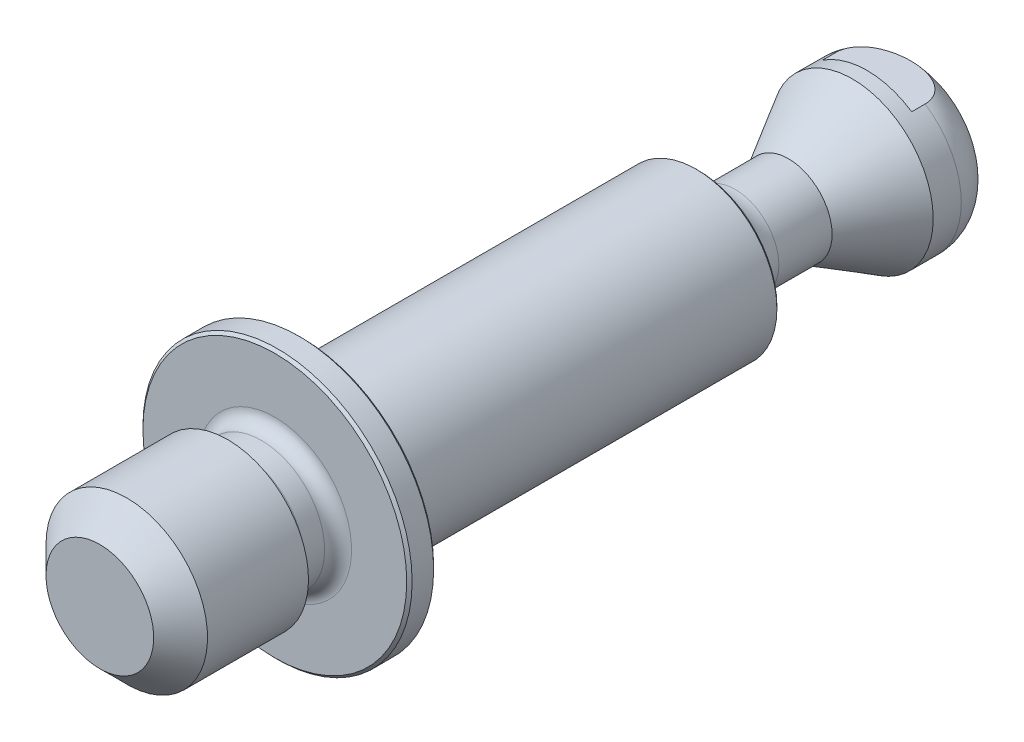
ISO-10303-21;
HEADER;
FILE_DESCRIPTION(('STEP AP214'),'2;1');
FILE_NAME('part.step','',(''),(''),'','','');
FILE_SCHEMA(('AUTOMOTIVE_DESIGN { 1 0 10303 214 1 1 1 1 }'));
ENDSEC;
DATA;
#1=APPLICATION_CONTEXT('core data for automotive mechanical design processes');
#2=APPLICATION_PROTOCOL_DEFINITION('international standard','automotive_design',2000,#1);
#3=PRODUCT_CONTEXT('',#1,'mechanical');
#4=PRODUCT('Part','Part','',(#3));
#5=PRODUCT_RELATED_PRODUCT_CATEGORY('part','',(#4));
#6=PRODUCT_DEFINITION_FORMATION('','',#4);
#7=PRODUCT_DEFINITION_CONTEXT('part definition',#1,'design');
#8=PRODUCT_DEFINITION('design','',#6,#7);
#9=PRODUCT_DEFINITION_SHAPE('','',#8);
#10=(LENGTH_UNIT() NAMED_UNIT(*) SI_UNIT(.MILLI.,.METRE.));
#11=(NAMED_UNIT(*) PLANE_ANGLE_UNIT() SI_UNIT($,.RADIAN.));
#12=(NAMED_UNIT(*) SI_UNIT($,.STERADIAN.) SOLID_ANGLE_UNIT());
#13=UNCERTAINTY_MEASURE_WITH_UNIT(LENGTH_MEASURE(1.E-05),#10,'distance_accuracy_value','');
#14=(GEOMETRIC_REPRESENTATION_CONTEXT(3) GLOBAL_UNCERTAINTY_ASSIGNED_CONTEXT((#13)) GLOBAL_UNIT_ASSIGNED_CONTEXT((#10,
#11,#12)) REPRESENTATION_CONTEXT('',''));
#15=CARTESIAN_POINT('',(0.,0.,0.));
#16=DIRECTION('',(0.,0.,1.));
#17=DIRECTION('',(1.,0.,0.));
#18=AXIS2_PLACEMENT_3D('',#15,#16,#17);
#19=CARTESIAN_POINT('',(0.,0.,0.));
#20=DIRECTION('',(0.,0.,1.));
#21=DIRECTION('',(-1.,0.,0.));
#22=AXIS2_PLACEMENT_3D('',#19,#20,#21);
#23=PLANE('',#22);
#24=CARTESIAN_POINT('',(0.,0.,0.));
#25=DIRECTION('',(0.,0.,1.));
#26=DIRECTION('',(-1.,0.,0.));
#27=AXIS2_PLACEMENT_3D('',#24,#25,#26);
#28=CIRCLE('',#27,9.8);
#29=CARTESIAN_POINT('',(-9.8,0.,0.));
#30=VERTEX_POINT('',#29);
#31=EDGE_CURVE('E154',#30,#30,#28,.T.);
#32=ORIENTED_EDGE('',*,*,#31,.T.);
#33=EDGE_LOOP('',(#32));
#34=FACE_BOUND('',#33,.T.);
#35=CARTESIAN_POINT('',(0.,0.,0.));
#36=DIRECTION('',(0.,0.,1.));
#37=DIRECTION('',(-1.,0.,0.));
#38=AXIS2_PLACEMENT_3D('',#35,#36,#37);
#39=CIRCLE('',#38,5.7);
#40=CARTESIAN_POINT('',(-5.7,0.,0.));
#41=VERTEX_POINT('',#40);
#42=EDGE_CURVE('E142',#41,#41,#39,.F.);
#43=ORIENTED_EDGE('',*,*,#42,.T.);
#44=EDGE_LOOP('',(#43));
#45=FACE_BOUND('',#44,.T.);
#46=ADVANCED_FACE('F15',(#34,#45),#23,.T.);
#47=CARTESIAN_POINT('',(0.,0.,0.));
#48=DIRECTION('',(0.,0.,-1.));
#49=DIRECTION('',(1.,0.,0.));
#50=AXIS2_PLACEMENT_3D('',#47,#48,#49);
#51=CYLINDRICAL_SURFACE('',#50,10.);
#52=CARTESIAN_POINT('',(0.,0.,-0.199999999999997));
#53=DIRECTION('',(0.,0.,1.));
#54=DIRECTION('',(-1.,0.,0.));
#55=AXIS2_PLACEMENT_3D('',#52,#53,#54);
#56=CIRCLE('',#55,10.);
#57=CARTESIAN_POINT('',(-10.,0.,-0.199999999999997));
#58=VERTEX_POINT('',#57);
#59=EDGE_CURVE('E150',#58,#58,#56,.F.);
#60=ORIENTED_EDGE('',*,*,#59,.T.);
#61=EDGE_LOOP('',(#60));
#62=FACE_BOUND('',#61,.T.);
#63=CARTESIAN_POINT('',(0.,0.,-1.8));
#64=DIRECTION('',(0.,0.,-1.));
#65=DIRECTION('',(1.,0.,0.));
#66=AXIS2_PLACEMENT_3D('',#63,#64,#65);
#67=CIRCLE('',#66,10.);
#68=CARTESIAN_POINT('',(10.,0.,-1.8));
#69=VERTEX_POINT('',#68);
#70=EDGE_CURVE('E146',#69,#69,#67,.F.);
#71=ORIENTED_EDGE('',*,*,#70,.T.);
#72=EDGE_LOOP('',(#71));
#73=FACE_BOUND('',#72,.T.);
#74=ADVANCED_FACE('F224',(#62,#73),#51,.T.);
#75=CARTESIAN_POINT('',(10.,0.,-2.));
#76=DIRECTION('',(0.,0.,-1.));
#77=DIRECTION('',(1.,0.,0.));
#78=AXIS2_PLACEMENT_3D('',#75,#76,#77);
#79=PLANE('',#78);
#80=CARTESIAN_POINT('',(0.,0.,-2.));
#81=DIRECTION('',(0.,0.,-1.));
#82=DIRECTION('',(1.,0.,0.));
#83=AXIS2_PLACEMENT_3D('',#80,#81,#82);
#84=CIRCLE('',#83,6.4);
#85=CARTESIAN_POINT('',(6.4,0.,-2.));
#86=VERTEX_POINT('',#85);
#87=EDGE_CURVE('E9',#86,#86,#84,.F.);
#88=ORIENTED_EDGE('',*,*,#87,.T.);
#89=EDGE_LOOP('',(#88));
#90=FACE_BOUND('',#89,.T.);
#91=CARTESIAN_POINT('',(0.,0.,-2.));
#92=DIRECTION('',(0.,0.,-1.));
#93=DIRECTION('',(1.,0.,0.));
#94=AXIS2_PLACEMENT_3D('',#91,#92,#93);
#95=CIRCLE('',#94,9.8);
#96=CARTESIAN_POINT('',(9.8,0.,-2.));
#97=VERTEX_POINT('',#96);
#98=EDGE_CURVE('E158',#97,#97,#95,.T.);
#99=ORIENTED_EDGE('',*,*,#98,.T.);
#100=EDGE_LOOP('',(#99));
#101=FACE_BOUND('',#100,.T.);
#102=ADVANCED_FACE('F220',(#90,#101),#79,.T.);
#103=CARTESIAN_POINT('',(0.,0.,0.));
#104=DIRECTION('',(0.,0.,-1.));
#105=DIRECTION('',(1.,0.,0.));
#106=AXIS2_PLACEMENT_3D('',#103,#104,#105);
#107=CYLINDRICAL_SURFACE('',#106,6.);
#108=CARTESIAN_POINT('',(0.,0.,-2.4));
#109=DIRECTION('',(0.,0.,-1.));
#110=DIRECTION('',(1.,0.,0.));
#111=AXIS2_PLACEMENT_3D('',#108,#109,#110);
#112=CIRCLE('',#111,6.);
#113=CARTESIAN_POINT('',(6.,0.,-2.4));
#114=VERTEX_POINT('',#113);
#115=EDGE_CURVE('E24',#114,#114,#112,.T.);
#116=ORIENTED_EDGE('',*,*,#115,.T.);
#117=EDGE_LOOP('',(#116));
#118=FACE_BOUND('',#117,.T.);
#119=CARTESIAN_POINT('',(0.,0.,-31.3));
#120=DIRECTION('',(0.,0.,-1.));
#121=DIRECTION('',(1.,0.,0.));
#122=AXIS2_PLACEMENT_3D('',#119,#120,#121);
#123=CIRCLE('',#122,6.);
#124=CARTESIAN_POINT('',(6.,0.,-31.3));
#125=VERTEX_POINT('',#124);
#126=EDGE_CURVE('E111',#125,#125,#123,.F.);
#127=ORIENTED_EDGE('',*,*,#126,.T.);
#128=EDGE_LOOP('',(#127));
#129=FACE_BOUND('',#128,.T.);
#130=ADVANCED_FACE('F216',(#118,#129),#107,.T.);
#131=CARTESIAN_POINT('',(0.,0.,0.));
#132=DIRECTION('',(0.,0.,-1.));
#133=DIRECTION('',(1.,0.,0.));
#134=AXIS2_PLACEMENT_3D('',#131,#132,#133);
#135=CYLINDRICAL_SURFACE('',#134,3.25);
#136=CARTESIAN_POINT('',(0.,0.,-34.1958301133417));
#137=DIRECTION('',(0.,0.,1.));
#138=DIRECTION('',(-1.,0.,0.));
#139=AXIS2_PLACEMENT_3D('',#136,#137,#138);
#140=CIRCLE('',#139,3.25);
#141=CARTESIAN_POINT('',(-3.25,0.,-34.1958301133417));
#142=VERTEX_POINT('',#141);
#143=EDGE_CURVE('E115',#142,#142,#140,.F.);
#144=ORIENTED_EDGE('',*,*,#143,.T.);
#145=EDGE_LOOP('',(#144));
#146=FACE_BOUND('',#145,.T.);
#147=CARTESIAN_POINT('',(0.,0.,-38.15));
#148=DIRECTION('',(0.,0.,-1.));
#149=DIRECTION('',(1.,0.,0.));
#150=AXIS2_PLACEMENT_3D('',#147,#148,#149);
#151=CIRCLE('',#150,3.25);
#152=CARTESIAN_POINT('',(3.25,0.,-38.15));
#153=VERTEX_POINT('',#152);
#154=EDGE_CURVE('E97',#153,#153,#151,.T.);
#155=ORIENTED_EDGE('',*,*,#154,.F.);
#156=EDGE_LOOP('',(#155));
#157=FACE_BOUND('',#156,.T.);
#158=ADVANCED_FACE('F212',(#146,#157),#135,.T.);
#159=CARTESIAN_POINT('',(0.,0.,-42.9131397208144));
#160=DIRECTION('',(0.,0.,-1.));
#161=DIRECTION('',(1.,0.,0.));
#162=AXIS2_PLACEMENT_3D('',#159,#160,#161);
#163=CONICAL_SURFACE('',#162,6.,0.523598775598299);
#164=ORIENTED_EDGE('',*,*,#154,.T.);
#165=EDGE_LOOP('',(#164));
#166=FACE_BOUND('',#165,.T.);
#167=CARTESIAN_POINT('',(0.,0.,-42.9131397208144));
#168=DIRECTION('',(0.,0.,-1.));
#169=DIRECTION('',(1.,0.,0.));
#170=AXIS2_PLACEMENT_3D('',#167,#168,#169);
#171=CIRCLE('',#170,6.);
#172=CARTESIAN_POINT('',(6.,0.,-42.9131397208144));
#173=VERTEX_POINT('',#172);
#174=EDGE_CURVE('E93',#173,#173,#171,.T.);
#175=ORIENTED_EDGE('',*,*,#174,.F.);
#176=EDGE_LOOP('',(#175));
#177=FACE_BOUND('',#176,.T.);
#178=ADVANCED_FACE('F209',(#166,#177),#163,.T.);
#179=CARTESIAN_POINT('',(0.,0.,0.));
#180=DIRECTION('',(0.,0.,-1.));
#181=DIRECTION('',(1.,0.,0.));
#182=AXIS2_PLACEMENT_3D('',#179,#180,#181);
#183=CYLINDRICAL_SURFACE('',#182,6.);
#184=DIRECTION('',(0.,0.,-1.));
#185=VECTOR('',#184,1.);
#186=CARTESIAN_POINT('',(3.31662479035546,-5.,0.));
#187=LINE('',#186,#185);
#188=CARTESIAN_POINT('',(3.31662479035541,-5.,-45.));
#189=VERTEX_POINT('',#188);
#190=CARTESIAN_POINT('',(3.31662479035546,-5.,-44.));
#191=VERTEX_POINT('',#190);
#192=EDGE_CURVE('E67',#189,#191,#187,.F.);
#193=ORIENTED_EDGE('',*,*,#192,.F.);
#194=CARTESIAN_POINT('',(0.,0.,-45.));
#195=DIRECTION('',(0.,0.,-1.));
#196=DIRECTION('',(1.,0.,0.));
#197=AXIS2_PLACEMENT_3D('',#194,#195,#196);
#198=CIRCLE('',#197,6.);
#199=CARTESIAN_POINT('',(3.31662479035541,5.,-45.));
#200=VERTEX_POINT('',#199);
#201=EDGE_CURVE('E39',#189,#200,#198,.F.);
#202=ORIENTED_EDGE('',*,*,#201,.T.);
#203=DIRECTION('',(0.,0.,-1.));
#204=VECTOR('',#203,1.);
#205=CARTESIAN_POINT('',(3.31662479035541,5.,0.));
#206=LINE('',#205,#204);
#207=CARTESIAN_POINT('',(3.31662479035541,5.,-44.));
#208=VERTEX_POINT('',#207);
#209=EDGE_CURVE('E86',#208,#200,#206,.T.);
#210=ORIENTED_EDGE('',*,*,#209,.F.);
#211=CARTESIAN_POINT('',(0.,0.,-44.));
#212=DIRECTION('',(0.,0.,1.));
#213=DIRECTION('',(0.,-1.,0.));
#214=AXIS2_PLACEMENT_3D('',#211,#212,#213);
#215=CIRCLE('',#214,6.);
#216=CARTESIAN_POINT('',(-3.31662479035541,5.,-44.));
#217=VERTEX_POINT('',#216);
#218=EDGE_CURVE('E170',#217,#208,#215,.F.);
#219=ORIENTED_EDGE('',*,*,#218,.F.);
#220=DIRECTION('',(0.,0.,-1.));
#221=VECTOR('',#220,1.);
#222=CARTESIAN_POINT('',(-3.31662479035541,5.,0.));
#223=LINE('',#222,#221);
#224=CARTESIAN_POINT('',(-3.31662479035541,5.,-45.));
#225=VERTEX_POINT('',#224);
#226=EDGE_CURVE('E89',#225,#217,#223,.F.);
#227=ORIENTED_EDGE('',*,*,#226,.F.);
#228=CARTESIAN_POINT('',(-3.31662479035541,-5.,-45.));
#229=VERTEX_POINT('',#228);
#230=EDGE_CURVE('E75',#225,#229,#198,.F.);
#231=ORIENTED_EDGE('',*,*,#230,.T.);
#232=DIRECTION('',(0.,0.,-1.));
#233=VECTOR('',#232,1.);
#234=CARTESIAN_POINT('',(-3.31662479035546,-5.,0.));
#235=LINE('',#234,#233);
#236=CARTESIAN_POINT('',(-3.31662479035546,-5.,-44.));
#237=VERTEX_POINT('',#236);
#238=EDGE_CURVE('E31',#237,#229,#235,.T.);
#239=ORIENTED_EDGE('',*,*,#238,.F.);
#240=CARTESIAN_POINT('',(0.,0.,-44.));
#241=DIRECTION('',(0.,0.,1.));
#242=DIRECTION('',(0.,-1.,0.));
#243=AXIS2_PLACEMENT_3D('',#240,#241,#242);
#244=CIRCLE('',#243,6.);
#245=EDGE_CURVE('E60',#191,#237,#244,.F.);
#246=ORIENTED_EDGE('',*,*,#245,.F.);
#247=EDGE_LOOP('',(#193,#202,#210,#219,#227,#231,#239,#246));
#248=FACE_BOUND('',#247,.T.);
#249=ORIENTED_EDGE('',*,*,#174,.T.);
#250=EDGE_LOOP('',(#249));
#251=FACE_BOUND('',#250,.T.);
#252=ADVANCED_FACE('F71',(#248,#251),#183,.T.);
#253=CARTESIAN_POINT('',(0.,0.,-48.));
#254=DIRECTION('',(0.,0.,-1.));
#255=DIRECTION('',(1.,0.,0.));
#256=AXIS2_PLACEMENT_3D('',#253,#254,#255);
#257=PLANE('',#256);
#258=CARTESIAN_POINT('',(0.,0.,-48.));
#259=DIRECTION('',(0.,0.,-1.));
#260=DIRECTION('',(1.,0.,0.));
#261=AXIS2_PLACEMENT_3D('',#258,#259,#260);
#262=CIRCLE('',#261,3.);
#263=CARTESIAN_POINT('',(3.,0.,-48.));
#264=VERTEX_POINT('',#263);
#265=EDGE_CURVE('E101',#264,#264,#262,.T.);
#266=ORIENTED_EDGE('',*,*,#265,.T.);
#267=EDGE_LOOP('',(#266));
#268=FACE_BOUND('',#267,.T.);
#269=ADVANCED_FACE('F203',(#268),#257,.T.);
#270=CARTESIAN_POINT('',(0.,0.,-45.));
#271=DIRECTION('',(0.,0.,-1.));
#272=DIRECTION('',(1.,0.,0.));
#273=AXIS2_PLACEMENT_3D('',#270,#271,#272);
#274=DEGENERATE_TOROIDAL_SURFACE('',#273,3.,3.,.T.);
#275=CARTESIAN_POINT('',(0.,-5.,-47.2360679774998));
#276=CARTESIAN_POINT('',(0.120918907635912,-5.,-47.2360654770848));
#277=CARTESIAN_POINT('',(0.241827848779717,-5.,-47.2321569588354));
#278=CARTESIAN_POINT('',(0.483117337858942,-5.,-47.2163673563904));
#279=CARTESIAN_POINT('',(0.603497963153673,-5.,-47.204487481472));
#280=CARTESIAN_POINT('',(0.843175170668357,-5.,-47.172309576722));
#281=CARTESIAN_POINT('',(0.962471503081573,-5.,-47.1520096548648));
#282=CARTESIAN_POINT('',(1.19911813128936,-5.,-47.1022831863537));
#283=CARTESIAN_POINT('',(1.31646901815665,-5.,-47.0728594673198));
#284=CARTESIAN_POINT('',(1.59010251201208,-5.,-46.9914925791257));
#285=CARTESIAN_POINT('',(1.74515200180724,-5.,-46.9352545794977));
#286=CARTESIAN_POINT('',(2.0457254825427,-5.,-46.8013699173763));
#287=CARTESIAN_POINT('',(2.19126336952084,-5.,-46.7237553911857));
#288=CARTESIAN_POINT('',(2.43890308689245,-5.,-46.5627711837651));
#289=CARTESIAN_POINT('',(2.54382254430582,-5.,-46.4837739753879));
#290=CARTESIAN_POINT('',(2.7396282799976,-5.,-46.3098769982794));
#291=CARTESIAN_POINT('',(2.83053188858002,-5.,-46.214997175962));
#292=CARTESIAN_POINT('',(2.97723052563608,-5.,-46.0301159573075));
#293=CARTESIAN_POINT('',(3.0364145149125,-5.,-45.942813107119));
#294=CARTESIAN_POINT('',(3.13957828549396,-5.,-45.7595839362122));
#295=CARTESIAN_POINT('',(3.18356514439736,-5.,-45.663661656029));
#296=CARTESIAN_POINT('',(3.25393965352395,-5.,-45.4648474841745));
#297=CARTESIAN_POINT('',(3.28022077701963,-5.,-45.3619174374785));
#298=CARTESIAN_POINT('',(3.31290834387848,-5.,-45.1529411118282));
#299=CARTESIAN_POINT('',(3.31932342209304,-5.,-45.0468962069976));
#300=CARTESIAN_POINT('',(3.31222176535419,-5.,-44.8462659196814));
#301=CARTESIAN_POINT('',(3.30065386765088,-5.,-44.7516055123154));
#302=CARTESIAN_POINT('',(3.26181910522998,-5.,-44.5655953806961));
#303=CARTESIAN_POINT('',(3.23455371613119,-5.,-44.4742453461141));
#304=CARTESIAN_POINT('',(3.16568011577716,-5.,-44.2967666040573));
#305=CARTESIAN_POINT('',(3.12401645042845,-5.,-44.2106596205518));
#306=CARTESIAN_POINT('',(3.02836892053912,-5.,-44.0456244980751));
#307=CARTESIAN_POINT('',(2.97437928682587,-5.,-43.9666997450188));
#308=CARTESIAN_POINT('',(2.83319578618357,-5.,-43.7878200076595));
#309=CARTESIAN_POINT('',(2.74125094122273,-5.,-43.6916074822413));
#310=CARTESIAN_POINT('',(2.54296994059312,-5.,-43.5154254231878));
#311=CARTESIAN_POINT('',(2.43660860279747,-5.,-43.4354849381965));
#312=CARTESIAN_POINT('',(2.16830650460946,-5.,-43.2616870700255));
#313=CARTESIAN_POINT('',(2.0014223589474,-5.,-43.1755042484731));
#314=CARTESIAN_POINT('',(1.65626349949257,-5.,-43.0302057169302));
#315=CARTESIAN_POINT('',(1.47796334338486,-5.,-42.9711530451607));
#316=CARTESIAN_POINT('',(1.15914275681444,-5.,-42.8876929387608));
#317=CARTESIAN_POINT('',(1.01985771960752,-5.,-42.8583678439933));
#318=CARTESIAN_POINT('',(0.739223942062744,-5.,-42.8117236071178));
#319=CARTESIAN_POINT('',(0.597874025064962,-5.,-42.7944116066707));
#320=CARTESIAN_POINT('',(0.314037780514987,-5.,-42.7709143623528));
#321=CARTESIAN_POINT('',(0.171549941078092,-5.,-42.7647478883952));
#322=CARTESIAN_POINT('',(-0.113440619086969,-5.,-42.7632671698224));
#323=CARTESIAN_POINT('',(-0.25594331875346,-5.,-42.7679492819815));
#324=CARTESIAN_POINT('',(-0.518018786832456,-5.,-42.7868218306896));
#325=CARTESIAN_POINT('',(-0.637707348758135,-5.,-42.7994184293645));
#326=CARTESIAN_POINT('',(-0.875936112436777,-5.,-42.8330000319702));
#327=CARTESIAN_POINT('',(-0.99447616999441,-5.,-42.8539860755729));
#328=CARTESIAN_POINT('',(-1.22924960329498,-5.,-42.9049977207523));
#329=CARTESIAN_POINT('',(-1.34548886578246,-5.,-42.9349958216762));
#330=CARTESIAN_POINT('',(-1.57487815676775,-5.,-43.0049676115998));
#331=CARTESIAN_POINT('',(-1.68802992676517,-5.,-43.0449355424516));
#332=CARTESIAN_POINT('',(-1.93726711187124,-5.,-43.1471729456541));
#333=CARTESIAN_POINT('',(-2.07212579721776,-5.,-43.2125115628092));
#334=CARTESIAN_POINT('',(-2.33077391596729,-5.,-43.3624490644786));
#335=CARTESIAN_POINT('',(-2.45457463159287,-5.,-43.4470279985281));
#336=CARTESIAN_POINT('',(-2.66253632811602,-5.,-43.6179675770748));
#337=CARTESIAN_POINT('',(-2.7496924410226,-5.,-43.7006594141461));
#338=CARTESIAN_POINT('',(-2.909419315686,-5.,-43.8791550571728));
#339=CARTESIAN_POINT('',(-2.98200679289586,-5.,-43.9749436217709));
#340=CARTESIAN_POINT('',(-3.0982354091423,-5.,-44.1618145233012));
#341=CARTESIAN_POINT('',(-3.14465751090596,-5.,-44.2511615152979));
#342=CARTESIAN_POINT('',(-3.22195881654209,-5.,-44.4363821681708));
#343=CARTESIAN_POINT('',(-3.25284467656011,-5.,-44.5322530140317));
#344=CARTESIAN_POINT('',(-3.29731276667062,-5.,-44.7283734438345));
#345=CARTESIAN_POINT('',(-3.31082509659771,-5.,-44.8286390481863));
#346=CARTESIAN_POINT('',(-3.31940920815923,-5.,-45.0299567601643));
#347=CARTESIAN_POINT('',(-3.31448404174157,-5.,-45.1310087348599));
#348=CARTESIAN_POINT('',(-3.28751634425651,-5.,-45.3236265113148));
#349=CARTESIAN_POINT('',(-3.26668052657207,-5.,-45.4153652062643));
#350=CARTESIAN_POINT('',(-3.21051142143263,-5.,-45.5942547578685));
#351=CARTESIAN_POINT('',(-3.17517729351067,-5.,-45.6814053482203));
#352=CARTESIAN_POINT('',(-3.08996682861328,-5.,-45.8529027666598));
#353=CARTESIAN_POINT('',(-3.03953428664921,-5.,-45.9369712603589));
#354=CARTESIAN_POINT('',(-2.92708168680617,-5.,-46.0969044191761));
#355=CARTESIAN_POINT('',(-2.86505640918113,-5.,-46.1727653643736));
#356=CARTESIAN_POINT('',(-2.70091379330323,-5.,-46.3486262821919));
#357=CARTESIAN_POINT('',(-2.59347912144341,-5.,-46.4436767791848));
#358=CARTESIAN_POINT('',(-2.3646875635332,-5.,-46.6152304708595));
#359=CARTESIAN_POINT('',(-2.24329783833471,-5.,-46.6916885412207));
#360=CARTESIAN_POINT('',(-1.93419060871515,-5.,-46.8581380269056));
#361=CARTESIAN_POINT('',(-1.74132926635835,-5.,-46.9385798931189));
#362=CARTESIAN_POINT('',(-1.44490972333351,-5.,-47.0360436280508));
#363=CARTESIAN_POINT('',(-1.34482286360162,-5.,-47.0646801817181));
#364=CARTESIAN_POINT('',(-1.14288449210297,-5.,-47.1148876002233));
#365=CARTESIAN_POINT('',(-1.04103334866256,-5.,-47.1364599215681));
#366=CARTESIAN_POINT('',(-0.783859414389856,-5.,-47.1824311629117));
#367=CARTESIAN_POINT('',(-0.627789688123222,-5.,-47.2026484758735));
#368=CARTESIAN_POINT('',(-0.314474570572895,-5.,-47.2294704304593));
#369=CARTESIAN_POINT('',(-0.157228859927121,-5.,-47.2360712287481));
#370=CARTESIAN_POINT('',(0.,-5.,-47.2360679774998));
#371=B_SPLINE_CURVE_WITH_KNOTS('',3,(#275,#276,#277,#278,#279,#280,#281,#282,#283,#284,#285,
#286,#287,#288,#289,#290,#291,#292,#293,#294,#295,#296,#297,#298,#299,#300,#301,#302,#303,#304,
#305,#306,#307,#308,#309,#310,#311,#312,#313,#314,#315,#316,#317,#318,#319,#320,#321,#322,#323,
#324,#325,#326,#327,#328,#329,#330,#331,#332,#333,#334,#335,#336,#337,#338,#339,#340,#341,#342,
#343,#344,#345,#346,#347,#348,#349,#350,#351,#352,#353,#354,#355,#356,#357,#358,#359,#360,#361,
#362,#363,#364,#365,#366,#367,#368,#369,#370),.UNSPECIFIED.,.T.,.F.,(4,2,2,2,2,2,2,2,2,2,2,2,2,
2,2,2,2,2,2,2,2,2,2,2,2,2,2,2,2,2,2,2,2,2,2,2,2,2,2,2,2,2,2,2,2,2,2,4),(0.,0.362673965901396,
0.725292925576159,1.08799341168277,1.45058160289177,1.94401806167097,2.43671672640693,
2.8293214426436,3.22143674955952,3.53657847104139,3.85157322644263,4.16844661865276,
4.48518226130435,4.76990781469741,5.05460660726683,5.34041435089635,5.6263561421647,
6.02338925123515,6.4211250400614,6.98148877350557,7.54314803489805,7.96962891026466,
8.39636310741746,8.82381529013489,9.25112394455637,9.61190509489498,9.97273096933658,
10.332466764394,10.6919952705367,11.1401969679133,11.5879360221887,11.9470202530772,
12.3056901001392,12.6064755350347,12.9071319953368,13.2089943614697,13.5108067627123,
13.791757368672,14.072724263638,14.3656805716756,14.6587691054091,15.0866864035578,
15.515632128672,16.1388153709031,16.4509640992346,16.7630484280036,17.2344943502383,
17.7060733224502),.UNSPECIFIED.);
#372=EDGE_CURVE('E64',#229,#189,#371,.T.);
#373=ORIENTED_EDGE('',*,*,#372,.F.);
#374=ORIENTED_EDGE('',*,*,#230,.F.);
#375=CARTESIAN_POINT('',(0.,5.,-47.2360679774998));
#376=CARTESIAN_POINT('',(-0.120918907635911,5.,-47.2360654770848));
#377=CARTESIAN_POINT('',(-0.241827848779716,5.,-47.2321569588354));
#378=CARTESIAN_POINT('',(-0.483117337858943,5.,-47.2163673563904));
#379=CARTESIAN_POINT('',(-0.603497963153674,5.,-47.204487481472));
#380=CARTESIAN_POINT('',(-0.843175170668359,5.,-47.172309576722));
#381=CARTESIAN_POINT('',(-0.962471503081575,5.,-47.1520096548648));
#382=CARTESIAN_POINT('',(-1.19911813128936,5.,-47.1022831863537));
#383=CARTESIAN_POINT('',(-1.31646901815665,5.,-47.0728594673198));
#384=CARTESIAN_POINT('',(-1.59010251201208,5.,-46.9914925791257));
#385=CARTESIAN_POINT('',(-1.74515200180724,5.,-46.9352545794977));
#386=CARTESIAN_POINT('',(-2.0457254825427,5.,-46.8013699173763));
#387=CARTESIAN_POINT('',(-2.19126336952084,5.,-46.7237553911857));
#388=CARTESIAN_POINT('',(-2.43890308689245,5.,-46.5627711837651));
#389=CARTESIAN_POINT('',(-2.54382254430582,5.,-46.4837739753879));
#390=CARTESIAN_POINT('',(-2.7396282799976,5.,-46.3098769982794));
#391=CARTESIAN_POINT('',(-2.83053188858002,5.,-46.214997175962));
#392=CARTESIAN_POINT('',(-2.97723052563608,5.,-46.0301159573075));
#393=CARTESIAN_POINT('',(-3.0364145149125,5.,-45.942813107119));
#394=CARTESIAN_POINT('',(-3.13957828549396,5.,-45.7595839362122));
#395=CARTESIAN_POINT('',(-3.18356514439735,5.,-45.663661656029));
#396=CARTESIAN_POINT('',(-3.25393965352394,5.,-45.4648474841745));
#397=CARTESIAN_POINT('',(-3.28022077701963,5.,-45.3619174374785));
#398=CARTESIAN_POINT('',(-3.31290834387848,5.,-45.1529411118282));
#399=CARTESIAN_POINT('',(-3.31932342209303,5.,-45.0468962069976));
#400=CARTESIAN_POINT('',(-3.31222176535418,5.,-44.8462659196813));
#401=CARTESIAN_POINT('',(-3.30065386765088,5.,-44.7516055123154));
#402=CARTESIAN_POINT('',(-3.26181910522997,5.,-44.5655953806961));
#403=CARTESIAN_POINT('',(-3.23455371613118,5.,-44.4742453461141));
#404=CARTESIAN_POINT('',(-3.16568011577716,5.,-44.2967666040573));
#405=CARTESIAN_POINT('',(-3.12401645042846,5.,-44.2106596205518));
#406=CARTESIAN_POINT('',(-3.02836892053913,5.,-44.0456244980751));
#407=CARTESIAN_POINT('',(-2.97437928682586,5.,-43.9666997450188));
#408=CARTESIAN_POINT('',(-2.83319578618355,5.,-43.7878200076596));
#409=CARTESIAN_POINT('',(-2.74125094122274,5.,-43.6916074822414));
#410=CARTESIAN_POINT('',(-2.54296994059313,5.,-43.5154254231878));
#411=CARTESIAN_POINT('',(-2.43660860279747,5.,-43.4354849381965));
#412=CARTESIAN_POINT('',(-2.16830650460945,5.,-43.2616870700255));
#413=CARTESIAN_POINT('',(-2.00142235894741,5.,-43.1755042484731));
#414=CARTESIAN_POINT('',(-1.65626349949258,5.,-43.0302057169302));
#415=CARTESIAN_POINT('',(-1.47796334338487,5.,-42.9711530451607));
#416=CARTESIAN_POINT('',(-1.15914275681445,5.,-42.8876929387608));
#417=CARTESIAN_POINT('',(-1.01985771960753,5.,-42.8583678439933));
#418=CARTESIAN_POINT('',(-0.739223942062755,5.,-42.8117236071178));
#419=CARTESIAN_POINT('',(-0.597874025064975,5.,-42.7944116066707));
#420=CARTESIAN_POINT('',(-0.314037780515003,5.,-42.7709143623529));
#421=CARTESIAN_POINT('',(-0.17154994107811,5.,-42.7647478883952));
#422=CARTESIAN_POINT('',(0.113440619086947,5.,-42.7632671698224));
#423=CARTESIAN_POINT('',(0.255943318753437,5.,-42.7679492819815));
#424=CARTESIAN_POINT('',(0.518018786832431,5.,-42.7868218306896));
#425=CARTESIAN_POINT('',(0.637707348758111,5.,-42.7994184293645));
#426=CARTESIAN_POINT('',(0.875936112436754,5.,-42.8330000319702));
#427=CARTESIAN_POINT('',(0.994476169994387,5.,-42.8539860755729));
#428=CARTESIAN_POINT('',(1.22924960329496,5.,-42.9049977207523));
#429=CARTESIAN_POINT('',(1.34548886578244,5.,-42.9349958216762));
#430=CARTESIAN_POINT('',(1.57487815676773,5.,-43.0049676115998));
#431=CARTESIAN_POINT('',(1.68802992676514,5.,-43.0449355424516));
#432=CARTESIAN_POINT('',(1.93726711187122,5.,-43.1471729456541));
#433=CARTESIAN_POINT('',(2.07212579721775,5.,-43.2125115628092));
#434=CARTESIAN_POINT('',(2.33077391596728,5.,-43.3624490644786));
#435=CARTESIAN_POINT('',(2.45457463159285,5.,-43.4470279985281));
#436=CARTESIAN_POINT('',(2.66253632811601,5.,-43.6179675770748));
#437=CARTESIAN_POINT('',(2.74969244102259,5.,-43.7006594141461));
#438=CARTESIAN_POINT('',(2.90941931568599,5.,-43.8791550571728));
#439=CARTESIAN_POINT('',(2.98200679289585,5.,-43.9749436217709));
#440=CARTESIAN_POINT('',(3.09823540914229,5.,-44.1618145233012));
#441=CARTESIAN_POINT('',(3.14465751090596,5.,-44.2511615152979));
#442=CARTESIAN_POINT('',(3.22195881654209,5.,-44.4363821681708));
#443=CARTESIAN_POINT('',(3.2528446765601,5.,-44.5322530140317));
#444=CARTESIAN_POINT('',(3.29731276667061,5.,-44.7283734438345));
#445=CARTESIAN_POINT('',(3.31082509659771,5.,-44.8286390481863));
#446=CARTESIAN_POINT('',(3.31940920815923,5.,-45.0299567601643));
#447=CARTESIAN_POINT('',(3.31448404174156,5.,-45.1310087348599));
#448=CARTESIAN_POINT('',(3.2875163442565,5.,-45.3236265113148));
#449=CARTESIAN_POINT('',(3.26668052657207,5.,-45.4153652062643));
#450=CARTESIAN_POINT('',(3.21051142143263,5.,-45.5942547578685));
#451=CARTESIAN_POINT('',(3.17517729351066,5.,-45.6814053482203));
#452=CARTESIAN_POINT('',(3.08996682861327,5.,-45.8529027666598));
#453=CARTESIAN_POINT('',(3.03953428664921,5.,-45.9369712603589));
#454=CARTESIAN_POINT('',(2.92708168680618,5.,-46.0969044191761));
#455=CARTESIAN_POINT('',(2.86505640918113,5.,-46.1727653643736));
#456=CARTESIAN_POINT('',(2.70091379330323,5.,-46.3486262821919));
#457=CARTESIAN_POINT('',(2.59347912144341,5.,-46.4436767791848));
#458=CARTESIAN_POINT('',(2.3646875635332,5.,-46.6152304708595));
#459=CARTESIAN_POINT('',(2.24329783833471,5.,-46.6916885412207));
#460=CARTESIAN_POINT('',(1.93419060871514,5.,-46.8581380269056));
#461=CARTESIAN_POINT('',(1.74132926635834,5.,-46.9385798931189));
#462=CARTESIAN_POINT('',(1.44490972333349,5.,-47.0360436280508));
#463=CARTESIAN_POINT('',(1.34482286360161,5.,-47.0646801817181));
#464=CARTESIAN_POINT('',(1.14288449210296,5.,-47.1148876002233));
#465=CARTESIAN_POINT('',(1.04103334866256,5.,-47.1364599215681));
#466=CARTESIAN_POINT('',(0.783859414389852,5.,-47.1824311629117));
#467=CARTESIAN_POINT('',(0.627789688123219,5.,-47.2026484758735));
#468=CARTESIAN_POINT('',(0.314474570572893,5.,-47.2294704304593));
#469=CARTESIAN_POINT('',(0.157228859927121,5.,-47.2360712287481));
#470=CARTESIAN_POINT('',(0.,5.,-47.2360679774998));
#471=B_SPLINE_CURVE_WITH_KNOTS('',3,(#375,#376,#377,#378,#379,#380,#381,#382,#383,#384,#385,
#386,#387,#388,#389,#390,#391,#392,#393,#394,#395,#396,#397,#398,#399,#400,#401,#402,#403,#404,
#405,#406,#407,#408,#409,#410,#411,#412,#413,#414,#415,#416,#417,#418,#419,#420,#421,#422,#423,
#424,#425,#426,#427,#428,#429,#430,#431,#432,#433,#434,#435,#436,#437,#438,#439,#440,#441,#442,
#443,#444,#445,#446,#447,#448,#449,#450,#451,#452,#453,#454,#455,#456,#457,#458,#459,#460,#461,
#462,#463,#464,#465,#466,#467,#468,#469,#470),.UNSPECIFIED.,.T.,.F.,(4,2,2,2,2,2,2,2,2,2,2,2,2,
2,2,2,2,2,2,2,2,2,2,2,2,2,2,2,2,2,2,2,2,2,2,2,2,2,2,2,2,2,2,2,2,2,2,4),(0.,0.362673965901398,
0.725292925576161,1.08799341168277,1.45058160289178,1.94401806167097,2.43671672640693,
2.8293214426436,3.22143674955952,3.53657847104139,3.85157322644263,4.16844661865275,
4.48518226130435,4.76990781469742,5.05460660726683,5.34041435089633,5.62635614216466,
6.02338925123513,6.4211250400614,6.98148877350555,7.54314803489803,7.96962891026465,
8.39636310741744,8.82381529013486,9.25112394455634,9.61190509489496,9.97273096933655,
10.332466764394,10.6919952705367,11.1401969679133,11.5879360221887,11.9470202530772,
12.3056901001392,12.6064755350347,12.9071319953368,13.2089943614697,13.5108067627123,
13.791757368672,14.072724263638,14.3656805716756,14.6587691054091,15.0866864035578,
15.515632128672,16.1388153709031,16.4509640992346,16.7630484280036,17.2344943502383,
17.7060733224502),.UNSPECIFIED.);
#472=EDGE_CURVE('E162',#200,#225,#471,.T.);
#473=ORIENTED_EDGE('',*,*,#472,.F.);
#474=ORIENTED_EDGE('',*,*,#201,.F.);
#475=EDGE_LOOP('',(#373,#374,#473,#474));
#476=FACE_BOUND('',#475,.T.);
#477=ORIENTED_EDGE('',*,*,#265,.F.);
#478=EDGE_LOOP('',(#477));
#479=FACE_BOUND('',#478,.T.);
#480=ADVANCED_FACE('F172',(#476,#479),#274,.T.);
#481=CARTESIAN_POINT('',(0.,0.,-31.5));
#482=DIRECTION('',(0.,0.,1.));
#483=DIRECTION('',(-1.,0.,0.));
#484=AXIS2_PLACEMENT_3D('',#481,#482,#483);
#485=CONICAL_SURFACE('',#484,5.8,0.785398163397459);
#486=ORIENTED_EDGE('',*,*,#126,.F.);
#487=EDGE_LOOP('',(#486));
#488=FACE_BOUND('',#487,.T.);
#489=CARTESIAN_POINT('',(0.,0.,-31.5));
#490=DIRECTION('',(0.,0.,-1.));
#491=DIRECTION('',(1.,0.,0.));
#492=AXIS2_PLACEMENT_3D('',#489,#490,#491);
#493=CIRCLE('',#492,5.8);
#494=CARTESIAN_POINT('',(5.8,0.,-31.5));
#495=VERTEX_POINT('',#494);
#496=EDGE_CURVE('E107',#495,#495,#493,.T.);
#497=ORIENTED_EDGE('',*,*,#496,.F.);
#498=EDGE_LOOP('',(#497));
#499=FACE_BOUND('',#498,.T.);
#500=ADVANCED_FACE('F323',(#488,#499),#485,.T.);
#501=CARTESIAN_POINT('',(0.,0.,-34.1958301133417));
#502=DIRECTION('',(0.,0.,1.));
#503=DIRECTION('',(-1.,0.,0.));
#504=AXIS2_PLACEMENT_3D('',#501,#502,#503);
#505=TOROIDAL_SURFACE('',#504,5.95,2.7);
#506=ORIENTED_EDGE('',*,*,#496,.T.);
#507=EDGE_LOOP('',(#506));
#508=FACE_BOUND('',#507,.T.);
#509=ORIENTED_EDGE('',*,*,#143,.F.);
#510=EDGE_LOOP('',(#509));
#511=FACE_BOUND('',#510,.T.);
#512=ADVANCED_FACE('F193',(#508,#511),#505,.F.);
#513=CARTESIAN_POINT('',(4.7,0.,3.5));
#514=DIRECTION('',(0.,0.,-1.));
#515=DIRECTION('',(0.,1.,0.));
#516=AXIS2_PLACEMENT_3D('',#513,#514,#515);
#517=PLANE('',#516);
#518=CARTESIAN_POINT('',(0.,0.,3.5));
#519=DIRECTION('',(0.,0.,-1.));
#520=DIRECTION('',(0.,1.,0.));
#521=AXIS2_PLACEMENT_3D('',#518,#519,#520);
#522=CIRCLE('',#521,5.7);
#523=CARTESIAN_POINT('',(0.,5.7,3.5));
#524=VERTEX_POINT('',#523);
#525=EDGE_CURVE('E130',#524,#524,#522,.F.);
#526=ORIENTED_EDGE('',*,*,#525,.T.);
#527=EDGE_LOOP('',(#526));
#528=FACE_BOUND('',#527,.T.);
#529=CARTESIAN_POINT('',(0.,0.,3.5));
#530=DIRECTION('',(0.,0.,-1.));
#531=DIRECTION('',(0.,1.,0.));
#532=AXIS2_PLACEMENT_3D('',#529,#530,#531);
#533=CIRCLE('',#532,6.);
#534=CARTESIAN_POINT('',(0.,6.,3.5));
#535=VERTEX_POINT('',#534);
#536=EDGE_CURVE('E92',#535,#535,#533,.T.);
#537=ORIENTED_EDGE('',*,*,#536,.T.);
#538=EDGE_LOOP('',(#537));
#539=FACE_BOUND('',#538,.T.);
#540=ADVANCED_FACE('F189',(#528,#539),#517,.T.);
#541=CARTESIAN_POINT('',(0.,0.,4.66905042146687));
#542=DIRECTION('',(0.,0.,1.));
#543=DIRECTION('',(0.,-1.,0.));
#544=AXIS2_PLACEMENT_3D('',#541,#542,#543);
#545=CYLINDRICAL_SURFACE('',#544,4.7);
#546=CARTESIAN_POINT('',(0.,0.,2.5));
#547=DIRECTION('',(0.,0.,-1.));
#548=DIRECTION('',(0.,1.,0.));
#549=AXIS2_PLACEMENT_3D('',#546,#547,#548);
#550=CIRCLE('',#549,4.7);
#551=CARTESIAN_POINT('',(0.,4.7,2.5));
#552=VERTEX_POINT('',#551);
#553=EDGE_CURVE('E138',#552,#552,#550,.T.);
#554=ORIENTED_EDGE('',*,*,#553,.T.);
#555=EDGE_LOOP('',(#554));
#556=FACE_BOUND('',#555,.T.);
#557=CARTESIAN_POINT('',(0.,0.,1.));
#558=DIRECTION('',(0.,0.,1.));
#559=DIRECTION('',(-1.,0.,0.));
#560=AXIS2_PLACEMENT_3D('',#557,#558,#559);
#561=CIRCLE('',#560,4.7);
#562=CARTESIAN_POINT('',(-4.7,0.,1.));
#563=VERTEX_POINT('',#562);
#564=EDGE_CURVE('E134',#563,#563,#561,.T.);
#565=ORIENTED_EDGE('',*,*,#564,.T.);
#566=EDGE_LOOP('',(#565));
#567=FACE_BOUND('',#566,.T.);
#568=ADVANCED_FACE('F185',(#556,#567),#545,.T.);
#569=CARTESIAN_POINT('',(0.,0.,13.));
#570=DIRECTION('',(0.,0.,1.));
#571=DIRECTION('',(-1.,0.,0.));
#572=AXIS2_PLACEMENT_3D('',#569,#570,#571);
#573=PLANE('',#572);
#574=CARTESIAN_POINT('',(0.,0.,13.));
#575=DIRECTION('',(0.,0.,1.));
#576=DIRECTION('',(-1.,0.,0.));
#577=AXIS2_PLACEMENT_3D('',#574,#575,#576);
#578=CIRCLE('',#577,4.);
#579=CARTESIAN_POINT('',(-4.,0.,13.));
#580=VERTEX_POINT('',#579);
#581=EDGE_CURVE('E119',#580,#580,#578,.T.);
#582=ORIENTED_EDGE('',*,*,#581,.T.);
#583=EDGE_LOOP('',(#582));
#584=FACE_BOUND('',#583,.T.);
#585=ADVANCED_FACE('F188',(#584),#573,.T.);
#586=CARTESIAN_POINT('',(0.,0.,13.));
#587=DIRECTION('',(0.,0.,-1.));
#588=DIRECTION('',(1.,0.,0.));
#589=AXIS2_PLACEMENT_3D('',#586,#587,#588);
#590=CYLINDRICAL_SURFACE('',#589,6.);
#591=CARTESIAN_POINT('',(0.,0.,11.));
#592=DIRECTION('',(0.,0.,1.));
#593=DIRECTION('',(-1.,0.,0.));
#594=AXIS2_PLACEMENT_3D('',#591,#592,#593);
#595=CIRCLE('',#594,6.);
#596=CARTESIAN_POINT('',(-6.,0.,11.));
#597=VERTEX_POINT('',#596);
#598=EDGE_CURVE('E126',#597,#597,#595,.F.);
#599=ORIENTED_EDGE('',*,*,#598,.T.);
#600=EDGE_LOOP('',(#599));
#601=FACE_BOUND('',#600,.T.);
#602=ORIENTED_EDGE('',*,*,#536,.F.);
#603=EDGE_LOOP('',(#602));
#604=FACE_BOUND('',#603,.T.);
#605=ADVANCED_FACE('F197',(#601,#604),#590,.T.);
#606=CARTESIAN_POINT('',(0.,0.,13.));
#607=DIRECTION('',(0.,0.,-1.));
#608=DIRECTION('',(1.,0.,0.));
#609=AXIS2_PLACEMENT_3D('',#606,#607,#608);
#610=CONICAL_SURFACE('',#609,4.,0.785398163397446);
#611=ORIENTED_EDGE('',*,*,#598,.F.);
#612=EDGE_LOOP('',(#611));
#613=FACE_BOUND('',#612,.T.);
#614=ORIENTED_EDGE('',*,*,#581,.F.);
#615=EDGE_LOOP('',(#614));
#616=FACE_BOUND('',#615,.T.);
#617=ADVANCED_FACE('F201',(#613,#616),#610,.T.);
#618=CARTESIAN_POINT('',(0.,0.,2.5));
#619=DIRECTION('',(0.,0.,-1.));
#620=DIRECTION('',(0.,1.,0.));
#621=AXIS2_PLACEMENT_3D('',#618,#619,#620);
#622=TOROIDAL_SURFACE('',#621,5.7,1.);
#623=ORIENTED_EDGE('',*,*,#553,.F.);
#624=EDGE_LOOP('',(#623));
#625=FACE_BOUND('',#624,.T.);
#626=ORIENTED_EDGE('',*,*,#525,.F.);
#627=EDGE_LOOP('',(#626));
#628=FACE_BOUND('',#627,.T.);
#629=ADVANCED_FACE('F241',(#625,#628),#622,.F.);
#630=CARTESIAN_POINT('',(0.,0.,1.));
#631=DIRECTION('',(0.,0.,1.));
#632=DIRECTION('',(-1.,0.,0.));
#633=AXIS2_PLACEMENT_3D('',#630,#631,#632);
#634=TOROIDAL_SURFACE('',#633,5.7,1.);
#635=ORIENTED_EDGE('',*,*,#42,.F.);
#636=EDGE_LOOP('',(#635));
#637=FACE_BOUND('',#636,.T.);
#638=ORIENTED_EDGE('',*,*,#564,.F.);
#639=EDGE_LOOP('',(#638));
#640=FACE_BOUND('',#639,.T.);
#641=ADVANCED_FACE('F237',(#637,#640),#634,.F.);
#642=CARTESIAN_POINT('',(0.,0.,-0.199999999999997));
#643=DIRECTION('',(0.,0.,-1.));
#644=DIRECTION('',(1.,0.,0.));
#645=AXIS2_PLACEMENT_3D('',#642,#643,#644);
#646=CONICAL_SURFACE('',#645,10.,0.785398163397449);
#647=ORIENTED_EDGE('',*,*,#31,.F.);
#648=EDGE_LOOP('',(#647));
#649=FACE_BOUND('',#648,.T.);
#650=ORIENTED_EDGE('',*,*,#59,.F.);
#651=EDGE_LOOP('',(#650));
#652=FACE_BOUND('',#651,.T.);
#653=ADVANCED_FACE('F240',(#649,#652),#646,.T.);
#654=CARTESIAN_POINT('',(0.,0.,-2.));
#655=DIRECTION('',(0.,0.,1.));
#656=DIRECTION('',(-1.,0.,0.));
#657=AXIS2_PLACEMENT_3D('',#654,#655,#656);
#658=CONICAL_SURFACE('',#657,9.8,0.785398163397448);
#659=ORIENTED_EDGE('',*,*,#70,.F.);
#660=EDGE_LOOP('',(#659));
#661=FACE_BOUND('',#660,.T.);
#662=ORIENTED_EDGE('',*,*,#98,.F.);
#663=EDGE_LOOP('',(#662));
#664=FACE_BOUND('',#663,.T.);
#665=ADVANCED_FACE('F182',(#661,#664),#658,.T.);
#666=CARTESIAN_POINT('',(-21.5,5.,-44.));
#667=DIRECTION('',(0.,-1.,0.));
#668=DIRECTION('',(1.,0.,0.));
#669=AXIS2_PLACEMENT_3D('',#666,#667,#668);
#670=PLANE('',#669);
#671=ORIENTED_EDGE('',*,*,#226,.T.);
#672=DIRECTION('',(1.,0.,0.));
#673=VECTOR('',#672,1.);
#674=CARTESIAN_POINT('',(-21.5,5.,-44.));
#675=LINE('',#674,#673);
#676=EDGE_CURVE('E80',#217,#208,#675,.T.);
#677=ORIENTED_EDGE('',*,*,#676,.T.);
#678=ORIENTED_EDGE('',*,*,#209,.T.);
#679=ORIENTED_EDGE('',*,*,#472,.T.);
#680=EDGE_LOOP('',(#671,#677,#678,#679));
#681=FACE_BOUND('',#680,.T.);
#682=ADVANCED_FACE('F176',(#681),#670,.F.);
#683=CARTESIAN_POINT('',(-21.5,5.,-44.));
#684=DIRECTION('',(0.,0.,1.));
#685=DIRECTION('',(0.,-1.,0.));
#686=AXIS2_PLACEMENT_3D('',#683,#684,#685);
#687=PLANE('',#686);
#688=ORIENTED_EDGE('',*,*,#218,.T.);
#689=ORIENTED_EDGE('',*,*,#676,.F.);
#690=EDGE_LOOP('',(#688,#689));
#691=FACE_BOUND('',#690,.T.);
#692=ADVANCED_FACE('F181',(#691),#687,.F.);
#693=CARTESIAN_POINT('',(-21.5,-5.,-44.));
#694=DIRECTION('',(0.,0.,1.));
#695=DIRECTION('',(0.,-1.,0.));
#696=AXIS2_PLACEMENT_3D('',#693,#694,#695);
#697=PLANE('',#696);
#698=ORIENTED_EDGE('',*,*,#245,.T.);
#699=DIRECTION('',(1.,0.,0.));
#700=VECTOR('',#699,1.);
#701=CARTESIAN_POINT('',(-21.5,-5.,-44.));
#702=LINE('',#701,#700);
#703=EDGE_CURVE('E62',#237,#191,#702,.T.);
#704=ORIENTED_EDGE('',*,*,#703,.T.);
#705=EDGE_LOOP('',(#698,#704));
#706=FACE_BOUND('',#705,.T.);
#707=ADVANCED_FACE('F61',(#706),#697,.F.);
#708=CARTESIAN_POINT('',(-21.5,-5.,-44.));
#709=DIRECTION('',(0.,1.,0.));
#710=DIRECTION('',(0.,0.,1.));
#711=AXIS2_PLACEMENT_3D('',#708,#709,#710);
#712=PLANE('',#711);
#713=ORIENTED_EDGE('',*,*,#192,.T.);
#714=ORIENTED_EDGE('',*,*,#703,.F.);
#715=ORIENTED_EDGE('',*,*,#238,.T.);
#716=ORIENTED_EDGE('',*,*,#372,.T.);
#717=EDGE_LOOP('',(#713,#714,#715,#716));
#718=FACE_BOUND('',#717,.T.);
#719=ADVANCED_FACE('F66',(#718),#712,.F.);
#720=CARTESIAN_POINT('',(0.,0.,-2.4));
#721=DIRECTION('',(0.,0.,-1.));
#722=DIRECTION('',(1.,0.,0.));
#723=AXIS2_PLACEMENT_3D('',#720,#721,#722);
#724=TOROIDAL_SURFACE('',#723,6.4,0.4);
#725=ORIENTED_EDGE('',*,*,#87,.F.);
#726=EDGE_LOOP('',(#725));
#727=FACE_BOUND('',#726,.T.);
#728=ORIENTED_EDGE('',*,*,#115,.F.);
#729=EDGE_LOOP('',(#728));
#730=FACE_BOUND('',#729,.T.);
#731=ADVANCED_FACE('F17',(#727,#730),#724,.F.);
#732=CLOSED_SHELL('',(#46,#74,#102,#130,#158,#178,#252,#269,#480,#500,#512,#540,#568,#585,#605,
#617,#629,#641,#653,#665,#682,#692,#707,#719,#731));
#733=MANIFOLD_SOLID_BREP('B1',#732);
#734=ADVANCED_BREP_SHAPE_REPRESENTATION('',(#18,#733),#14);
#735=SHAPE_DEFINITION_REPRESENTATION(#9,#734);
ENDSEC;
END-ISO-10303-21;
